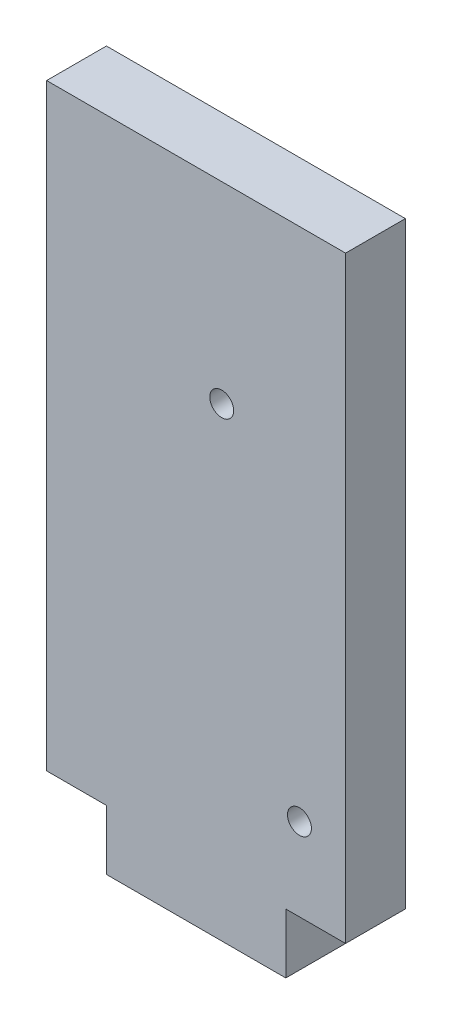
from build123d import *

# Parameters (mm, degrees)
SKETCH1_W           = 15
SKETCH1_H           = 5
BOSS_EXTRUDE1_DEPTH = 5
SKETCH2_W           = 25
SKETCH2_H           = 5
BOSS_EXTRUDE2_DEPTH = 50
SKETCH3_R           = 1
CUT_EXTRUDE1_DEPTH  = 50


with BuildPart() as part:
    # Sketch1 → Boss-Extrude1 (new body)
    with BuildSketch(Plane(origin=(0, 0, 0), x_dir=(1, 0, 0), z_dir=(0, 1, 0))):
        Rectangle(SKETCH1_W, SKETCH1_H)
    extrude(amount=BOSS_EXTRUDE1_DEPTH)

    # Sketch2 → Boss-Extrude2 (add)
    with BuildSketch(Plane(origin=(0, 5, 0), x_dir=(1, 0, 0), z_dir=(0, 1, 0))):
        Rectangle(SKETCH2_W, SKETCH2_H)
    extrude(amount=BOSS_EXTRUDE2_DEPTH)

    # Sketch3 → Cut-Extrude1 (cut)
    with BuildSketch(Plane.XY.offset(2.5)):
        with Locations((8.642880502, 11.903529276)):
            Circle(SKETCH3_R)
        with Locations((2.142880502, 38.903529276)):
            Circle(SKETCH3_R)
    extrude(amount=-CUT_EXTRUDE1_DEPTH, mode=Mode.SUBTRACT)


solid = part.part
